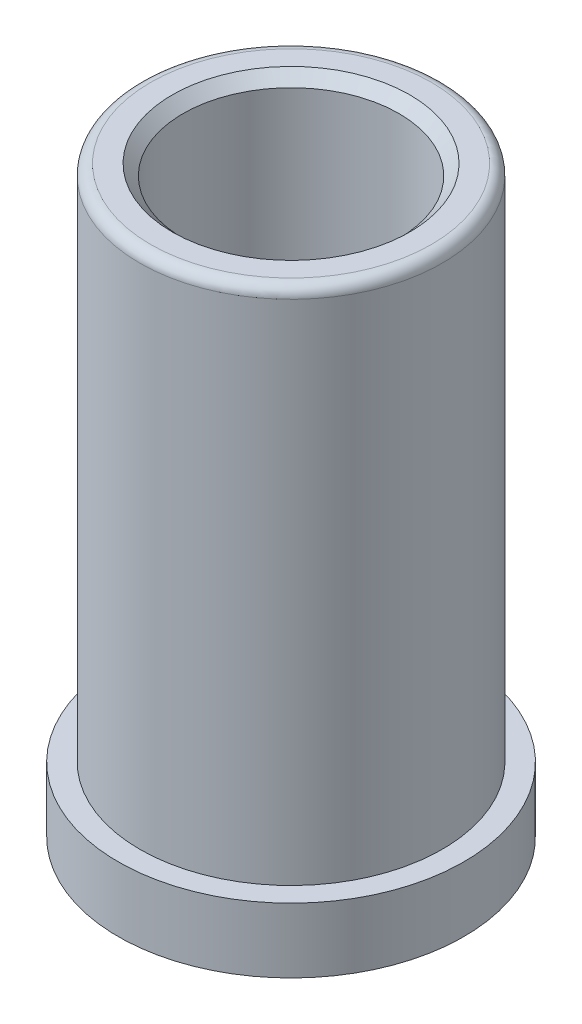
ISO-10303-21;
HEADER;
FILE_DESCRIPTION(('STEP AP214'),'2;1');
FILE_NAME('part.step','',(''),(''),'','','');
FILE_SCHEMA(('AUTOMOTIVE_DESIGN { 1 0 10303 214 1 1 1 1 }'));
ENDSEC;
DATA;
#1=APPLICATION_CONTEXT('core data for automotive mechanical design processes');
#2=APPLICATION_PROTOCOL_DEFINITION('international standard','automotive_design',2000,#1);
#3=PRODUCT_CONTEXT('',#1,'mechanical');
#4=PRODUCT('Part','Part','',(#3));
#5=PRODUCT_RELATED_PRODUCT_CATEGORY('part','',(#4));
#6=PRODUCT_DEFINITION_FORMATION('','',#4);
#7=PRODUCT_DEFINITION_CONTEXT('part definition',#1,'design');
#8=PRODUCT_DEFINITION('design','',#6,#7);
#9=PRODUCT_DEFINITION_SHAPE('','',#8);
#10=(LENGTH_UNIT() NAMED_UNIT(*) SI_UNIT(.MILLI.,.METRE.));
#11=(NAMED_UNIT(*) PLANE_ANGLE_UNIT() SI_UNIT($,.RADIAN.));
#12=(NAMED_UNIT(*) SI_UNIT($,.STERADIAN.) SOLID_ANGLE_UNIT());
#13=UNCERTAINTY_MEASURE_WITH_UNIT(LENGTH_MEASURE(1.E-05),#10,'distance_accuracy_value','');
#14=(GEOMETRIC_REPRESENTATION_CONTEXT(3) GLOBAL_UNCERTAINTY_ASSIGNED_CONTEXT((#13)) GLOBAL_UNIT_ASSIGNED_CONTEXT((#10,
#11,#12)) REPRESENTATION_CONTEXT('',''));
#15=CARTESIAN_POINT('',(0.,0.,0.));
#16=DIRECTION('',(0.,0.,1.));
#17=DIRECTION('',(1.,0.,0.));
#18=AXIS2_PLACEMENT_3D('',#15,#16,#17);
#19=CARTESIAN_POINT('',(0.,0.,0.));
#20=DIRECTION('',(0.,-1.,0.));
#21=DIRECTION('',(0.,0.,-1.));
#22=AXIS2_PLACEMENT_3D('',#19,#20,#21);
#23=CYLINDRICAL_SURFACE('',#22,7.);
#24=CARTESIAN_POINT('',(0.,23.5,0.));
#25=DIRECTION('',(0.,-1.,0.));
#26=DIRECTION('',(0.,0.,-1.));
#27=AXIS2_PLACEMENT_3D('',#24,#25,#26);
#28=CIRCLE('',#27,7.);
#29=CARTESIAN_POINT('',(0.,23.5,-7.));
#30=VERTEX_POINT('',#29);
#31=EDGE_CURVE('E21',#30,#30,#28,.T.);
#32=ORIENTED_EDGE('',*,*,#31,.T.);
#33=EDGE_LOOP('',(#32));
#34=FACE_BOUND('',#33,.T.);
#35=CARTESIAN_POINT('',(0.,0.,0.));
#36=DIRECTION('',(0.,-1.,0.));
#37=DIRECTION('',(0.,0.,-1.));
#38=AXIS2_PLACEMENT_3D('',#35,#36,#37);
#39=CIRCLE('',#38,7.);
#40=CARTESIAN_POINT('',(0.,0.,-7.));
#41=VERTEX_POINT('',#40);
#42=EDGE_CURVE('E49',#41,#41,#39,.T.);
#43=ORIENTED_EDGE('',*,*,#42,.F.);
#44=EDGE_LOOP('',(#43));
#45=FACE_BOUND('',#44,.T.);
#46=ADVANCED_FACE('F14',(#34,#45),#23,.T.);
#47=CARTESIAN_POINT('',(-7.,24.,0.));
#48=DIRECTION('',(0.,-1.,0.));
#49=DIRECTION('',(0.,0.,-1.));
#50=AXIS2_PLACEMENT_3D('',#47,#48,#49);
#51=PLANE('',#50);
#52=CARTESIAN_POINT('',(0.,24.,0.));
#53=DIRECTION('',(0.,-1.,0.));
#54=DIRECTION('',(0.,0.,-1.));
#55=AXIS2_PLACEMENT_3D('',#52,#53,#54);
#56=CIRCLE('',#55,6.5);
#57=CARTESIAN_POINT('',(0.,24.,-6.5));
#58=VERTEX_POINT('',#57);
#59=EDGE_CURVE('E9',#58,#58,#56,.F.);
#60=ORIENTED_EDGE('',*,*,#59,.T.);
#61=EDGE_LOOP('',(#60));
#62=FACE_BOUND('',#61,.T.);
#63=CARTESIAN_POINT('',(0.,24.,0.));
#64=DIRECTION('',(0.,-1.,0.));
#65=DIRECTION('',(0.,0.,-1.));
#66=AXIS2_PLACEMENT_3D('',#63,#64,#65);
#67=CIRCLE('',#66,5.5);
#68=CARTESIAN_POINT('',(0.,24.,-5.5));
#69=VERTEX_POINT('',#68);
#70=EDGE_CURVE('E37',#69,#69,#67,.T.);
#71=ORIENTED_EDGE('',*,*,#70,.T.);
#72=EDGE_LOOP('',(#71));
#73=FACE_BOUND('',#72,.T.);
#74=ADVANCED_FACE('F56',(#62,#73),#51,.F.);
#75=CARTESIAN_POINT('',(0.,0.,0.));
#76=DIRECTION('',(0.,-1.,0.));
#77=DIRECTION('',(0.,0.,-1.));
#78=AXIS2_PLACEMENT_3D('',#75,#76,#77);
#79=CYLINDRICAL_SURFACE('',#78,5.);
#80=CARTESIAN_POINT('',(0.,23.5,0.));
#81=DIRECTION('',(0.,-1.,0.));
#82=DIRECTION('',(0.,0.,-1.));
#83=AXIS2_PLACEMENT_3D('',#80,#81,#82);
#84=CIRCLE('',#83,5.);
#85=CARTESIAN_POINT('',(0.,23.5,-5.));
#86=VERTEX_POINT('',#85);
#87=EDGE_CURVE('E34',#86,#86,#84,.F.);
#88=ORIENTED_EDGE('',*,*,#87,.T.);
#89=EDGE_LOOP('',(#88));
#90=FACE_BOUND('',#89,.T.);
#91=CARTESIAN_POINT('',(0.,-3.,0.));
#92=DIRECTION('',(0.,-1.,0.));
#93=DIRECTION('',(0.,0.,-1.));
#94=AXIS2_PLACEMENT_3D('',#91,#92,#93);
#95=CIRCLE('',#94,5.);
#96=CARTESIAN_POINT('',(0.,-3.,-5.));
#97=VERTEX_POINT('',#96);
#98=EDGE_CURVE('E40',#97,#97,#95,.T.);
#99=ORIENTED_EDGE('',*,*,#98,.T.);
#100=EDGE_LOOP('',(#99));
#101=FACE_BOUND('',#100,.T.);
#102=ADVANCED_FACE('F63',(#90,#101),#79,.F.);
#103=CARTESIAN_POINT('',(0.,-3.15,0.));
#104=DIRECTION('',(0.,-1.,0.));
#105=DIRECTION('',(0.,0.,-1.));
#106=AXIS2_PLACEMENT_3D('',#103,#104,#105);
#107=CONICAL_SURFACE('',#106,5.1,0.588002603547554);
#108=CARTESIAN_POINT('',(0.,-3.36,0.));
#109=DIRECTION('',(0.,1.,0.));
#110=DIRECTION('',(0.,0.,1.));
#111=AXIS2_PLACEMENT_3D('',#108,#109,#110);
#112=CIRCLE('',#111,5.24);
#113=CARTESIAN_POINT('',(0.,-3.36,5.24));
#114=VERTEX_POINT('',#113);
#115=EDGE_CURVE('E25',#114,#114,#112,.F.);
#116=ORIENTED_EDGE('',*,*,#115,.T.);
#117=EDGE_LOOP('',(#116));
#118=FACE_BOUND('',#117,.T.);
#119=ORIENTED_EDGE('',*,*,#98,.F.);
#120=EDGE_LOOP('',(#119));
#121=FACE_BOUND('',#120,.T.);
#122=ADVANCED_FACE('F82',(#118,#121),#107,.F.);
#123=CARTESIAN_POINT('',(-5.1,-3.,0.));
#124=DIRECTION('',(0.,1.,0.));
#125=DIRECTION('',(0.,0.,1.));
#126=AXIS2_PLACEMENT_3D('',#123,#124,#125);
#127=PLANE('',#126);
#128=CARTESIAN_POINT('',(0.,-3.,0.));
#129=DIRECTION('',(0.,1.,0.));
#130=DIRECTION('',(0.,0.,1.));
#131=AXIS2_PLACEMENT_3D('',#128,#129,#130);
#132=CIRCLE('',#131,5.6);
#133=CARTESIAN_POINT('',(0.,-3.,5.6));
#134=VERTEX_POINT('',#133);
#135=EDGE_CURVE('E29',#134,#134,#132,.T.);
#136=ORIENTED_EDGE('',*,*,#135,.T.);
#137=EDGE_LOOP('',(#136));
#138=FACE_BOUND('',#137,.T.);
#139=CARTESIAN_POINT('',(0.,-3.,0.));
#140=DIRECTION('',(0.,-1.,0.));
#141=DIRECTION('',(0.,0.,-1.));
#142=AXIS2_PLACEMENT_3D('',#139,#140,#141);
#143=CIRCLE('',#142,8.);
#144=CARTESIAN_POINT('',(0.,-3.,-8.));
#145=VERTEX_POINT('',#144);
#146=EDGE_CURVE('E43',#145,#145,#143,.T.);
#147=ORIENTED_EDGE('',*,*,#146,.T.);
#148=EDGE_LOOP('',(#147));
#149=FACE_BOUND('',#148,.T.);
#150=ADVANCED_FACE('F85',(#138,#149),#127,.F.);
#151=CARTESIAN_POINT('',(0.,0.,0.));
#152=DIRECTION('',(0.,-1.,0.));
#153=DIRECTION('',(0.,0.,-1.));
#154=AXIS2_PLACEMENT_3D('',#151,#152,#153);
#155=CYLINDRICAL_SURFACE('',#154,8.);
#156=ORIENTED_EDGE('',*,*,#146,.F.);
#157=EDGE_LOOP('',(#156));
#158=FACE_BOUND('',#157,.T.);
#159=CARTESIAN_POINT('',(0.,0.,0.));
#160=DIRECTION('',(0.,-1.,0.));
#161=DIRECTION('',(0.,0.,-1.));
#162=AXIS2_PLACEMENT_3D('',#159,#160,#161);
#163=CIRCLE('',#162,8.);
#164=CARTESIAN_POINT('',(0.,0.,-8.));
#165=VERTEX_POINT('',#164);
#166=EDGE_CURVE('E46',#165,#165,#163,.T.);
#167=ORIENTED_EDGE('',*,*,#166,.T.);
#168=EDGE_LOOP('',(#167));
#169=FACE_BOUND('',#168,.T.);
#170=ADVANCED_FACE('F97',(#158,#169),#155,.T.);
#171=CARTESIAN_POINT('',(-8.,0.,0.));
#172=DIRECTION('',(0.,-1.,0.));
#173=DIRECTION('',(0.,0.,-1.));
#174=AXIS2_PLACEMENT_3D('',#171,#172,#173);
#175=PLANE('',#174);
#176=ORIENTED_EDGE('',*,*,#166,.F.);
#177=EDGE_LOOP('',(#176));
#178=FACE_BOUND('',#177,.T.);
#179=ORIENTED_EDGE('',*,*,#42,.T.);
#180=EDGE_LOOP('',(#179));
#181=FACE_BOUND('',#180,.T.);
#182=ADVANCED_FACE('F53',(#178,#181),#175,.F.);
#183=CARTESIAN_POINT('',(0.,24.,0.));
#184=DIRECTION('',(0.,1.,0.));
#185=DIRECTION('',(0.,0.,1.));
#186=AXIS2_PLACEMENT_3D('',#183,#184,#185);
#187=CONICAL_SURFACE('',#186,5.5,0.785398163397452);
#188=ORIENTED_EDGE('',*,*,#87,.F.);
#189=EDGE_LOOP('',(#188));
#190=FACE_BOUND('',#189,.T.);
#191=ORIENTED_EDGE('',*,*,#70,.F.);
#192=EDGE_LOOP('',(#191));
#193=FACE_BOUND('',#192,.T.);
#194=ADVANCED_FACE('F67',(#190,#193),#187,.F.);
#195=CARTESIAN_POINT('',(0.,-3.5,0.));
#196=DIRECTION('',(0.,1.,0.));
#197=DIRECTION('',(0.,0.,1.));
#198=AXIS2_PLACEMENT_3D('',#195,#196,#197);
#199=CONICAL_SURFACE('',#198,5.1,0.785398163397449);
#200=ORIENTED_EDGE('',*,*,#135,.F.);
#201=EDGE_LOOP('',(#200));
#202=FACE_BOUND('',#201,.T.);
#203=ORIENTED_EDGE('',*,*,#115,.F.);
#204=EDGE_LOOP('',(#203));
#205=FACE_BOUND('',#204,.T.);
#206=ADVANCED_FACE('F69',(#202,#205),#199,.T.);
#207=CARTESIAN_POINT('',(0.,23.5,0.));
#208=DIRECTION('',(0.,-1.,0.));
#209=DIRECTION('',(0.,0.,-1.));
#210=AXIS2_PLACEMENT_3D('',#207,#208,#209);
#211=TOROIDAL_SURFACE('',#210,6.5,0.5);
#212=ORIENTED_EDGE('',*,*,#59,.F.);
#213=EDGE_LOOP('',(#212));
#214=FACE_BOUND('',#213,.T.);
#215=ORIENTED_EDGE('',*,*,#31,.F.);
#216=EDGE_LOOP('',(#215));
#217=FACE_BOUND('',#216,.T.);
#218=ADVANCED_FACE('F16',(#214,#217),#211,.T.);
#219=CLOSED_SHELL('',(#46,#74,#102,#122,#150,#170,#182,#194,#206,#218));
#220=MANIFOLD_SOLID_BREP('B1',#219);
#221=ADVANCED_BREP_SHAPE_REPRESENTATION('',(#18,#220),#14);
#222=SHAPE_DEFINITION_REPRESENTATION(#9,#221);
ENDSEC;
END-ISO-10303-21;
